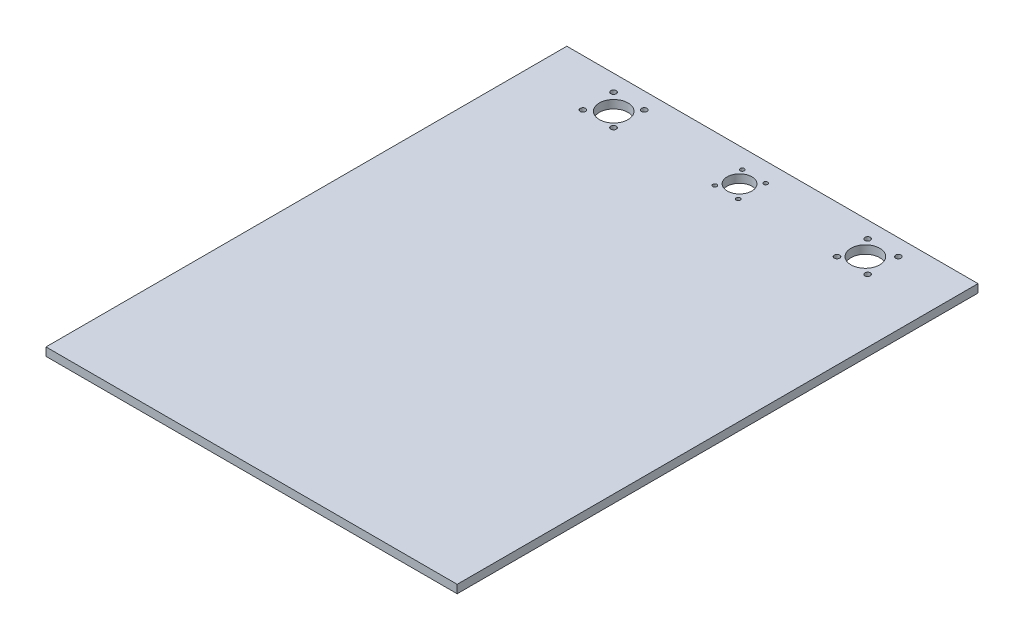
from build123d import *

# Parameters (mm, degrees)
SKETCH1_W           = 300
SKETCH1_H           = 380
SKETCH1_R           = 9
SKETCH1_R_2         = 10.5
SKETCH1_R_3         = 2
SKETCH1_R_4         = 1.5
BOSS_EXTRUDE1_DEPTH = 6


with BuildPart() as part:
    # Sketch1 → Boss-Extrude1 (new body)
    with BuildSketch(Plane(origin=(0, 0, 0), x_dir=(1, 0, 0), z_dir=(0, 1, 0))):
        Rectangle(SKETCH1_W, SKETCH1_H)
        with Locations(Location((0, 166, 0), (0, 0, 270))):
            Circle(SKETCH1_R, mode=Mode.SUBTRACT)
        with Locations(Location((-91.8, 166, 0), (0, 0, 270))):
            Circle(SKETCH1_R_2, mode=Mode.SUBTRACT)
        with Locations(Location((91.8, 166, 0), (0, 0, 270))):
            Circle(SKETCH1_R_2, mode=Mode.SUBTRACT)
        with Locations(Location((-103.9, 178, 0), (0, 0, 270))):
            Circle(SKETCH1_R_3, mode=Mode.SUBTRACT)
        with Locations(Location((-81.5, 178, 0), (0, 0, 270))):
            Circle(SKETCH1_R_3, mode=Mode.SUBTRACT)
        with Locations(Location((-103.9, 155.6, 0), (0, 0, 270))):
            Circle(SKETCH1_R_3, mode=Mode.SUBTRACT)
        with Locations(Location((-81.5, 155.6, 0), (0, 0, 270))):
            Circle(SKETCH1_R_3, mode=Mode.SUBTRACT)
        with Locations(Location((103.9, 178, 0), (0, 0, 90))):
            Circle(SKETCH1_R_3, mode=Mode.SUBTRACT)
        with Locations(Location((103.9, 155.6, 0), (0, 0, 90))):
            Circle(SKETCH1_R_3, mode=Mode.SUBTRACT)
        with Locations(Location((81.5, 155.6, 0), (0, 0, 90))):
            Circle(SKETCH1_R_3, mode=Mode.SUBTRACT)
        with Locations(Location((81.5, 178, 0), (0, 0, 90))):
            Circle(SKETCH1_R_3, mode=Mode.SUBTRACT)
        with Locations(Location((-8, 176, 0), (0, 0, 270))):
            Circle(SKETCH1_R_4, mode=Mode.SUBTRACT)
        with Locations(Location((9.1, 176, 0), (0, 0, 270))):
            Circle(SKETCH1_R_4, mode=Mode.SUBTRACT)
        with Locations(Location((9.1, 156, 0), (0, 0, 270))):
            Circle(SKETCH1_R_4, mode=Mode.SUBTRACT)
        with Locations(Location((-8, 156, 0), (0, 0, 270))):
            Circle(SKETCH1_R_4, mode=Mode.SUBTRACT)
    extrude(amount=BOSS_EXTRUDE1_DEPTH)


solid = part.part
